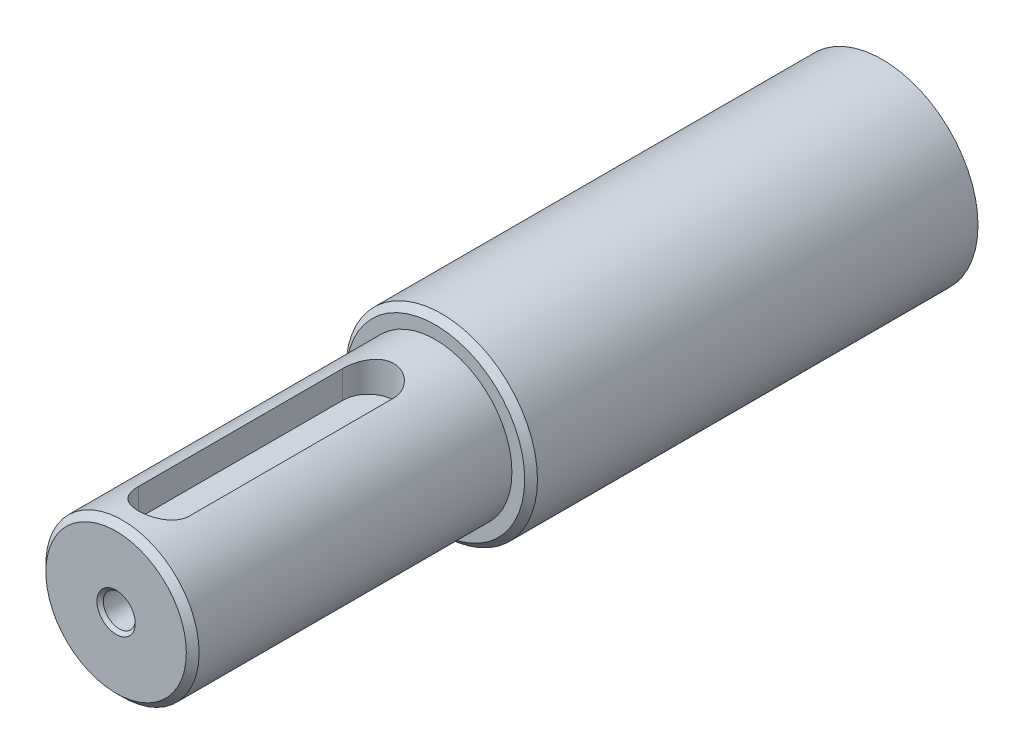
from build123d import *

# Parameters (mm, degrees)
ESQUISSE1_R             = 15
EXTRUSION1_DEPTH        = 70
ESQUISSE2_R             = 12
EXTRUSION2_DEPTH        = 50
CHANFREIN1_SIZE         = 1
ENL_V_MAT_EXTRU_1_DEPTH = 123.9186723
TROU_TARAUD_M61_D       = 5
TROU_TARAUD_M61_DEPTH   = 17
TROU_TARAUD_M61_TIP     = 1.502151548
CHANFREIN2_SIZE         = 0.5


with BuildPart() as part:
    # Esquisse1 → Extrusion1 (new body)
    with BuildSketch(Plane.XY):
        Circle(ESQUISSE1_R)
    extrude(amount=EXTRUSION1_DEPTH)

    # Esquisse2 → Extrusion2 (add)
    with BuildSketch(Plane.XY.offset(70)):
        Circle(ESQUISSE2_R)
    extrude(amount=EXTRUSION2_DEPTH)

    # Chanfrein1
    chanfrein1_edges = [part.edges().sort_by_distance(p)[0] for p in [
        (-15, 0, 70),
        (-12, 0, 120),
    ]]
    chamfer(chanfrein1_edges, length=CHANFREIN1_SIZE)

    # Esquisse3 → Enl_v. mat.-Extru.1 (cut, through all)
    with BuildSketch(Plane(origin=(0, 7, 0), x_dir=(-1, 0, 0), z_dir=(0, 1, 0))):
        with BuildLine():
            Line((4, 112.5), (4, 80.5))
            ThreePointArc((4, 80.5), (0, 76.5), (-4, 80.5))
            Line((-4, 80.5), (-4, 112.5))
            ThreePointArc((-4, 112.5), (0, 116.5), (4, 112.5))
        make_face()
    extrude(amount=ENL_V_MAT_EXTRU_1_DEPTH, mode=Mode.SUBTRACT)

    # Trou taraud_ M61
    with Locations(Plane.XY.offset(120)):
        with Locations((0, 0)):
            Hole(TROU_TARAUD_M61_D / 2, depth=TROU_TARAUD_M61_DEPTH)
            with Locations((0, 0, -(TROU_TARAUD_M61_DEPTH + TROU_TARAUD_M61_TIP / 2))):  # 118° drill point
                Cone(0, TROU_TARAUD_M61_D / 2, TROU_TARAUD_M61_TIP, mode=Mode.SUBTRACT)

    # Chanfrein2
    chanfrein2_edges = [part.edges().sort_by_distance(p)[0] for p in [
        (2.5, 0, 120),
    ]]
    chamfer(chanfrein2_edges, length=CHANFREIN2_SIZE)


solid = part.part
